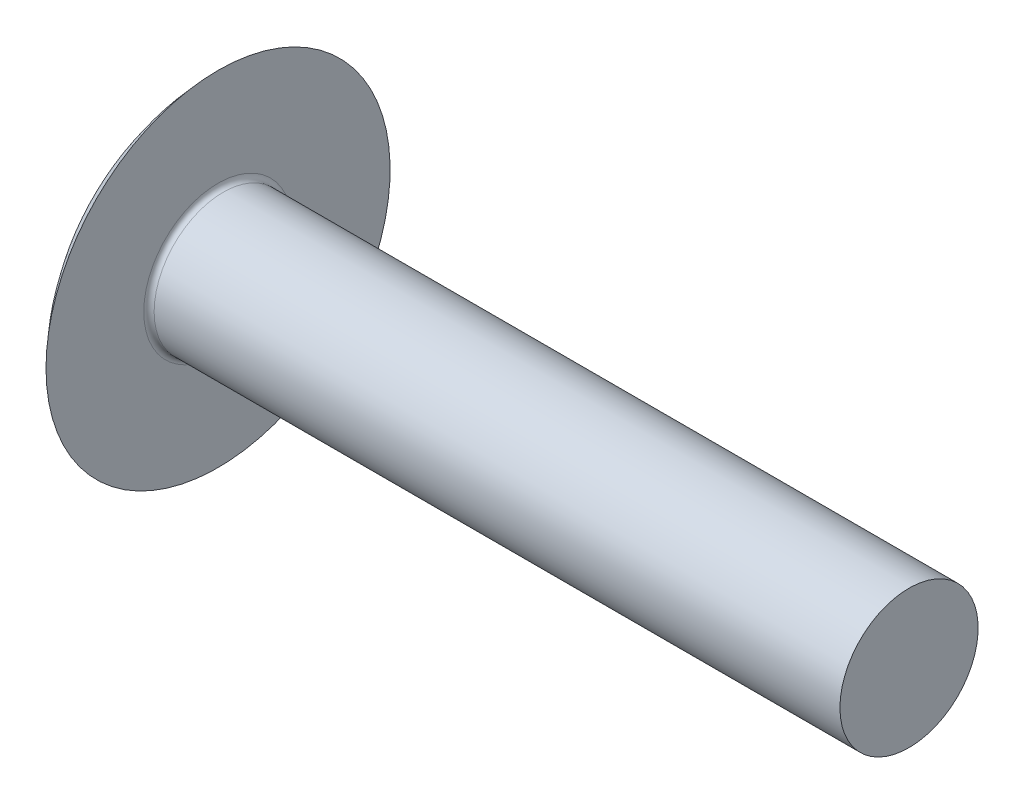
ISO-10303-21;
HEADER;
FILE_DESCRIPTION(('STEP AP214'),'2;1');
FILE_NAME('part.step','',(''),(''),'','','');
FILE_SCHEMA(('AUTOMOTIVE_DESIGN { 1 0 10303 214 1 1 1 1 }'));
ENDSEC;
DATA;
#1=APPLICATION_CONTEXT('core data for automotive mechanical design processes');
#2=APPLICATION_PROTOCOL_DEFINITION('international standard','automotive_design',2000,#1);
#3=PRODUCT_CONTEXT('',#1,'mechanical');
#4=PRODUCT('Part','Part','',(#3));
#5=PRODUCT_RELATED_PRODUCT_CATEGORY('part','',(#4));
#6=PRODUCT_DEFINITION_FORMATION('','',#4);
#7=PRODUCT_DEFINITION_CONTEXT('part definition',#1,'design');
#8=PRODUCT_DEFINITION('design','',#6,#7);
#9=PRODUCT_DEFINITION_SHAPE('','',#8);
#10=(LENGTH_UNIT() NAMED_UNIT(*) SI_UNIT(.MILLI.,.METRE.));
#11=(NAMED_UNIT(*) PLANE_ANGLE_UNIT() SI_UNIT($,.RADIAN.));
#12=(NAMED_UNIT(*) SI_UNIT($,.STERADIAN.) SOLID_ANGLE_UNIT());
#13=UNCERTAINTY_MEASURE_WITH_UNIT(LENGTH_MEASURE(1.E-05),#10,'distance_accuracy_value','');
#14=(GEOMETRIC_REPRESENTATION_CONTEXT(3) GLOBAL_UNCERTAINTY_ASSIGNED_CONTEXT((#13)) GLOBAL_UNIT_ASSIGNED_CONTEXT((#10,
#11,#12)) REPRESENTATION_CONTEXT('',''));
#15=CARTESIAN_POINT('',(0.,0.,0.));
#16=DIRECTION('',(0.,0.,1.));
#17=DIRECTION('',(1.,0.,0.));
#18=AXIS2_PLACEMENT_3D('',#15,#16,#17);
#19=CARTESIAN_POINT('',(43.9620495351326,0.,0.));
#20=DIRECTION('',(-1.,0.,0.));
#21=DIRECTION('',(0.,0.,1.));
#22=AXIS2_PLACEMENT_3D('',#19,#20,#21);
#23=PLANE('',#22);
#24=CARTESIAN_POINT('',(43.9620495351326,0.,0.));
#25=DIRECTION('',(-1.,0.,0.));
#26=DIRECTION('',(0.,0.,1.));
#27=AXIS2_PLACEMENT_3D('',#24,#25,#26);
#28=CIRCLE('',#27,4.00000000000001);
#29=CARTESIAN_POINT('',(43.9620495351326,0.,4.00000000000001));
#30=VERTEX_POINT('',#29);
#31=EDGE_CURVE('E10',#30,#30,#28,.T.);
#32=ORIENTED_EDGE('',*,*,#31,.F.);
#33=EDGE_LOOP('',(#32));
#34=FACE_BOUND('',#33,.T.);
#35=ADVANCED_FACE('F37',(#34),#23,.F.);
#36=CARTESIAN_POINT('',(-60.0944134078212,0.,0.));
#37=DIRECTION('',(-1.,0.,0.));
#38=DIRECTION('',(0.,0.,1.));
#39=AXIS2_PLACEMENT_3D('',#36,#37,#38);
#40=CYLINDRICAL_SURFACE('',#39,4.);
#41=CARTESIAN_POINT('',(4.26204953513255,0.,0.));
#42=DIRECTION('',(-1.,0.,0.));
#43=DIRECTION('',(0.,0.,1.));
#44=AXIS2_PLACEMENT_3D('',#41,#42,#43);
#45=CIRCLE('',#44,4.);
#46=CARTESIAN_POINT('',(4.26204953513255,0.,4.));
#47=VERTEX_POINT('',#46);
#48=EDGE_CURVE('E43',#47,#47,#45,.T.);
#49=ORIENTED_EDGE('',*,*,#48,.F.);
#50=EDGE_LOOP('',(#49));
#51=FACE_BOUND('',#50,.T.);
#52=ORIENTED_EDGE('',*,*,#31,.T.);
#53=EDGE_LOOP('',(#52));
#54=FACE_BOUND('',#53,.T.);
#55=ADVANCED_FACE('F67',(#51,#54),#40,.T.);
#56=CARTESIAN_POINT('',(4.26204953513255,0.,0.));
#57=DIRECTION('',(-1.,0.,0.));
#58=DIRECTION('',(0.,0.,1.));
#59=AXIS2_PLACEMENT_3D('',#56,#57,#58);
#60=TOROIDAL_SURFACE('',#59,4.3,0.300000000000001);
#61=CARTESIAN_POINT('',(3.96204953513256,0.,0.));
#62=DIRECTION('',(-1.,0.,0.));
#63=DIRECTION('',(0.,0.,1.));
#64=AXIS2_PLACEMENT_3D('',#61,#62,#63);
#65=CIRCLE('',#64,4.3);
#66=CARTESIAN_POINT('',(3.96204953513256,0.,4.3));
#67=VERTEX_POINT('',#66);
#68=EDGE_CURVE('E47',#67,#67,#65,.T.);
#69=ORIENTED_EDGE('',*,*,#68,.F.);
#70=EDGE_LOOP('',(#69));
#71=FACE_BOUND('',#70,.T.);
#72=ORIENTED_EDGE('',*,*,#48,.T.);
#73=EDGE_LOOP('',(#72));
#74=FACE_BOUND('',#73,.T.);
#75=ADVANCED_FACE('F62',(#71,#74),#60,.F.);
#76=CARTESIAN_POINT('',(3.96204953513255,4.3,0.));
#77=DIRECTION('',(-1.,0.,0.));
#78=DIRECTION('',(0.,0.,1.));
#79=AXIS2_PLACEMENT_3D('',#76,#77,#78);
#80=PLANE('',#79);
#81=CARTESIAN_POINT('',(3.96204953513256,0.,0.));
#82=DIRECTION('',(-1.,0.,0.));
#83=DIRECTION('',(0.,0.,1.));
#84=AXIS2_PLACEMENT_3D('',#81,#82,#83);
#85=CIRCLE('',#84,9.96);
#86=CARTESIAN_POINT('',(3.96204953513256,0.,9.96));
#87=VERTEX_POINT('',#86);
#88=EDGE_CURVE('E51',#87,#87,#85,.T.);
#89=ORIENTED_EDGE('',*,*,#88,.F.);
#90=EDGE_LOOP('',(#89));
#91=FACE_BOUND('',#90,.T.);
#92=ORIENTED_EDGE('',*,*,#68,.T.);
#93=EDGE_LOOP('',(#92));
#94=FACE_BOUND('',#93,.T.);
#95=ADVANCED_FACE('F59',(#91,#94),#80,.F.);
#96=CARTESIAN_POINT('',(14.5,0.,0.));
#97=DIRECTION('',(-1.,0.,0.));
#98=DIRECTION('',(0.,1.,0.));
#99=AXIS2_PLACEMENT_3D('',#96,#97,#98);
#100=SPHERICAL_SURFACE('',#99,14.5);
#101=ORIENTED_EDGE('',*,*,#88,.T.);
#102=EDGE_LOOP('',(#101));
#103=FACE_BOUND('',#102,.T.);
#104=ADVANCED_FACE('F57',(#103),#100,.T.);
#105=CLOSED_SHELL('',(#35,#55,#75,#95,#104));
#106=MANIFOLD_SOLID_BREP('B2',#105);
#107=ADVANCED_BREP_SHAPE_REPRESENTATION('',(#18,#106),#14);
#108=SHAPE_DEFINITION_REPRESENTATION(#9,#107);
ENDSEC;
END-ISO-10303-21;
